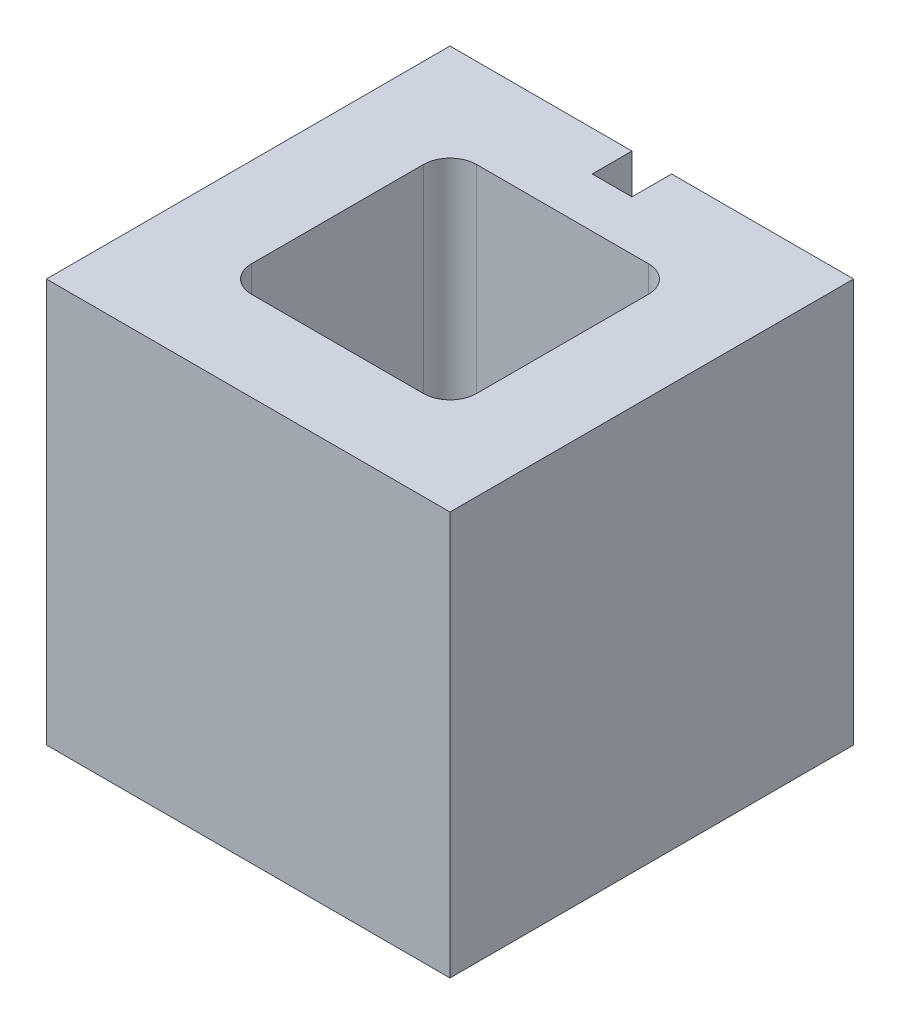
ISO-10303-21;
HEADER;
FILE_DESCRIPTION(('STEP AP214'),'2;1');
FILE_NAME('part.step','',(''),(''),'','','');
FILE_SCHEMA(('AUTOMOTIVE_DESIGN { 1 0 10303 214 1 1 1 1 }'));
ENDSEC;
DATA;
#1=APPLICATION_CONTEXT('core data for automotive mechanical design processes');
#2=APPLICATION_PROTOCOL_DEFINITION('international standard','automotive_design',2000,#1);
#3=PRODUCT_CONTEXT('',#1,'mechanical');
#4=PRODUCT('Part','Part','',(#3));
#5=PRODUCT_RELATED_PRODUCT_CATEGORY('part','',(#4));
#6=PRODUCT_DEFINITION_FORMATION('','',#4);
#7=PRODUCT_DEFINITION_CONTEXT('part definition',#1,'design');
#8=PRODUCT_DEFINITION('design','',#6,#7);
#9=PRODUCT_DEFINITION_SHAPE('','',#8);
#10=(LENGTH_UNIT() NAMED_UNIT(*) SI_UNIT(.MILLI.,.METRE.));
#11=(NAMED_UNIT(*) PLANE_ANGLE_UNIT() SI_UNIT($,.RADIAN.));
#12=(NAMED_UNIT(*) SI_UNIT($,.STERADIAN.) SOLID_ANGLE_UNIT());
#13=UNCERTAINTY_MEASURE_WITH_UNIT(LENGTH_MEASURE(1.E-05),#10,'distance_accuracy_value','');
#14=(GEOMETRIC_REPRESENTATION_CONTEXT(3) GLOBAL_UNCERTAINTY_ASSIGNED_CONTEXT((#13)) GLOBAL_UNIT_ASSIGNED_CONTEXT((#10,
#11,#12)) REPRESENTATION_CONTEXT('',''));
#15=CARTESIAN_POINT('',(0.,0.,0.));
#16=DIRECTION('',(0.,0.,1.));
#17=DIRECTION('',(1.,0.,0.));
#18=AXIS2_PLACEMENT_3D('',#15,#16,#17);
#19=CARTESIAN_POINT('',(0.,193.675,-193.675));
#20=DIRECTION('',(0.,0.,1.));
#21=DIRECTION('',(1.,0.,0.));
#22=AXIS2_PLACEMENT_3D('',#19,#20,#21);
#23=PLANE('',#22);
#24=DIRECTION('',(-1.,0.,0.));
#25=VECTOR('',#24,1.);
#26=CARTESIAN_POINT('',(0.,193.675,-193.675));
#27=LINE('',#26,#25);
#28=CARTESIAN_POINT('',(87.3125,193.675,-193.675));
#29=VERTEX_POINT('',#28);
#30=CARTESIAN_POINT('',(0.,193.675,-193.675));
#31=VERTEX_POINT('',#30);
#32=EDGE_CURVE('E263',#29,#31,#27,.T.);
#33=ORIENTED_EDGE('',*,*,#32,.F.);
#34=DIRECTION('',(0.,1.,0.));
#35=VECTOR('',#34,1.);
#36=CARTESIAN_POINT('',(87.3125,-0.001000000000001,-193.675));
#37=LINE('',#36,#35);
#38=CARTESIAN_POINT('',(87.3125,0.,-193.675));
#39=VERTEX_POINT('',#38);
#40=EDGE_CURVE('E155',#39,#29,#37,.T.);
#41=ORIENTED_EDGE('',*,*,#40,.F.);
#42=DIRECTION('',(-1.,0.,0.));
#43=VECTOR('',#42,1.);
#44=CARTESIAN_POINT('',(0.,0.,-193.675));
#45=LINE('',#44,#43);
#46=CARTESIAN_POINT('',(0.,0.,-193.675));
#47=VERTEX_POINT('',#46);
#48=EDGE_CURVE('E172',#39,#47,#45,.T.);
#49=ORIENTED_EDGE('',*,*,#48,.T.);
#50=DIRECTION('',(0.,-1.,0.));
#51=VECTOR('',#50,1.);
#52=CARTESIAN_POINT('',(0.,193.675,-193.675));
#53=LINE('',#52,#51);
#54=EDGE_CURVE('E181',#31,#47,#53,.T.);
#55=ORIENTED_EDGE('',*,*,#54,.F.);
#56=EDGE_LOOP('',(#33,#41,#49,#55));
#57=FACE_BOUND('',#56,.T.);
#58=ADVANCED_FACE('F30',(#57),#23,.F.);
#59=CARTESIAN_POINT('',(0.,193.675,0.));
#60=DIRECTION('',(1.,0.,0.));
#61=DIRECTION('',(0.,0.,-1.));
#62=AXIS2_PLACEMENT_3D('',#59,#60,#61);
#63=PLANE('',#62);
#64=DIRECTION('',(0.,0.,1.));
#65=VECTOR('',#64,1.);
#66=CARTESIAN_POINT('',(0.,0.,0.));
#67=LINE('',#66,#65);
#68=CARTESIAN_POINT('',(0.,0.,0.));
#69=VERTEX_POINT('',#68);
#70=EDGE_CURVE('E258',#47,#69,#67,.T.);
#71=ORIENTED_EDGE('',*,*,#70,.T.);
#72=DIRECTION('',(0.,-1.,0.));
#73=VECTOR('',#72,1.);
#74=CARTESIAN_POINT('',(0.,193.675,0.));
#75=LINE('',#74,#73);
#76=CARTESIAN_POINT('',(0.,193.675,0.));
#77=VERTEX_POINT('',#76);
#78=EDGE_CURVE('E189',#77,#69,#75,.T.);
#79=ORIENTED_EDGE('',*,*,#78,.F.);
#80=DIRECTION('',(0.,0.,1.));
#81=VECTOR('',#80,1.);
#82=CARTESIAN_POINT('',(0.,193.675,0.));
#83=LINE('',#82,#81);
#84=EDGE_CURVE('E171',#31,#77,#83,.T.);
#85=ORIENTED_EDGE('',*,*,#84,.F.);
#86=ORIENTED_EDGE('',*,*,#54,.T.);
#87=EDGE_LOOP('',(#71,#79,#85,#86));
#88=FACE_BOUND('',#87,.T.);
#89=ADVANCED_FACE('F278',(#88),#63,.F.);
#90=CARTESIAN_POINT('',(0.,193.675,0.));
#91=DIRECTION('',(0.,0.,-1.));
#92=DIRECTION('',(-1.,0.,0.));
#93=AXIS2_PLACEMENT_3D('',#90,#91,#92);
#94=PLANE('',#93);
#95=DIRECTION('',(1.,0.,0.));
#96=VECTOR('',#95,1.);
#97=CARTESIAN_POINT('',(0.,0.,0.));
#98=LINE('',#97,#96);
#99=CARTESIAN_POINT('',(193.675,0.,0.));
#100=VERTEX_POINT('',#99);
#101=EDGE_CURVE('E266',#69,#100,#98,.T.);
#102=ORIENTED_EDGE('',*,*,#101,.T.);
#103=DIRECTION('',(0.,-1.,0.));
#104=VECTOR('',#103,1.);
#105=CARTESIAN_POINT('',(193.675,193.675,0.));
#106=LINE('',#105,#104);
#107=CARTESIAN_POINT('',(193.675,193.675,0.));
#108=VERTEX_POINT('',#107);
#109=EDGE_CURVE('E186',#108,#100,#106,.T.);
#110=ORIENTED_EDGE('',*,*,#109,.F.);
#111=DIRECTION('',(1.,0.,0.));
#112=VECTOR('',#111,1.);
#113=CARTESIAN_POINT('',(0.,193.675,0.));
#114=LINE('',#113,#112);
#115=EDGE_CURVE('E175',#77,#108,#114,.T.);
#116=ORIENTED_EDGE('',*,*,#115,.F.);
#117=ORIENTED_EDGE('',*,*,#78,.T.);
#118=EDGE_LOOP('',(#102,#110,#116,#117));
#119=FACE_BOUND('',#118,.T.);
#120=ADVANCED_FACE('F275',(#119),#94,.F.);
#121=CARTESIAN_POINT('',(193.675,193.675,0.));
#122=DIRECTION('',(-1.,0.,0.));
#123=DIRECTION('',(0.,0.,1.));
#124=AXIS2_PLACEMENT_3D('',#121,#122,#123);
#125=PLANE('',#124);
#126=DIRECTION('',(0.,0.,-1.));
#127=VECTOR('',#126,1.);
#128=CARTESIAN_POINT('',(193.675,0.,0.));
#129=LINE('',#128,#127);
#130=CARTESIAN_POINT('',(193.675,0.,-193.675));
#131=VERTEX_POINT('',#130);
#132=EDGE_CURVE('E177',#100,#131,#129,.T.);
#133=ORIENTED_EDGE('',*,*,#132,.T.);
#134=DIRECTION('',(0.,-1.,0.));
#135=VECTOR('',#134,1.);
#136=CARTESIAN_POINT('',(193.675,193.675,-193.675));
#137=LINE('',#136,#135);
#138=CARTESIAN_POINT('',(193.675,193.675,-193.675));
#139=VERTEX_POINT('',#138);
#140=EDGE_CURVE('E170',#139,#131,#137,.T.);
#141=ORIENTED_EDGE('',*,*,#140,.F.);
#142=DIRECTION('',(0.,0.,-1.));
#143=VECTOR('',#142,1.);
#144=CARTESIAN_POINT('',(193.675,193.675,0.));
#145=LINE('',#144,#143);
#146=EDGE_CURVE('E261',#108,#139,#145,.T.);
#147=ORIENTED_EDGE('',*,*,#146,.F.);
#148=ORIENTED_EDGE('',*,*,#109,.T.);
#149=EDGE_LOOP('',(#133,#141,#147,#148));
#150=FACE_BOUND('',#149,.T.);
#151=ADVANCED_FACE('F270',(#150),#125,.F.);
#152=CARTESIAN_POINT('',(106.3625,0.,-193.675));
#153=VERTEX_POINT('',#152);
#154=EDGE_CURVE('E163',#131,#153,#45,.T.);
#155=ORIENTED_EDGE('',*,*,#154,.T.);
#156=DIRECTION('',(0.,1.,0.));
#157=VECTOR('',#156,1.);
#158=CARTESIAN_POINT('',(106.3625,-0.001000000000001,-193.675));
#159=LINE('',#158,#157);
#160=CARTESIAN_POINT('',(106.3625,193.675,-193.675));
#161=VERTEX_POINT('',#160);
#162=EDGE_CURVE('E144',#153,#161,#159,.T.);
#163=ORIENTED_EDGE('',*,*,#162,.T.);
#164=EDGE_CURVE('E184',#139,#161,#27,.T.);
#165=ORIENTED_EDGE('',*,*,#164,.F.);
#166=ORIENTED_EDGE('',*,*,#140,.T.);
#167=EDGE_LOOP('',(#155,#163,#165,#166));
#168=FACE_BOUND('',#167,.T.);
#169=ADVANCED_FACE('F168',(#168),#23,.F.);
#170=CARTESIAN_POINT('',(0.,193.675,-193.675));
#171=DIRECTION('',(0.,-1.,0.));
#172=DIRECTION('',(0.,0.,-1.));
#173=AXIS2_PLACEMENT_3D('',#170,#171,#172);
#174=PLANE('',#173);
#175=DIRECTION('',(1.,0.,0.));
#176=VECTOR('',#175,1.);
#177=CARTESIAN_POINT('',(42.8625,193.675,-42.8625));
#178=LINE('',#177,#176);
#179=CARTESIAN_POINT('',(55.5625,193.675,-42.8625));
#180=VERTEX_POINT('',#179);
#181=CARTESIAN_POINT('',(138.1125,193.675,-42.8625));
#182=VERTEX_POINT('',#181);
#183=EDGE_CURVE('E247',#180,#182,#178,.T.);
#184=ORIENTED_EDGE('',*,*,#183,.F.);
#185=CARTESIAN_POINT('',(55.5625,193.675,-55.5625));
#186=DIRECTION('',(0.,-1.,0.));
#187=DIRECTION('',(0.,0.,-1.));
#188=AXIS2_PLACEMENT_3D('',#185,#186,#187);
#189=CIRCLE('',#188,12.7);
#190=CARTESIAN_POINT('',(42.8625,193.675,-55.5625));
#191=VERTEX_POINT('',#190);
#192=EDGE_CURVE('E211',#180,#191,#189,.T.);
#193=ORIENTED_EDGE('',*,*,#192,.T.);
#194=DIRECTION('',(0.,0.,1.));
#195=VECTOR('',#194,1.);
#196=CARTESIAN_POINT('',(42.8625,193.675,-150.8125));
#197=LINE('',#196,#195);
#198=CARTESIAN_POINT('',(42.8625,193.675,-138.1125));
#199=VERTEX_POINT('',#198);
#200=EDGE_CURVE('E229',#199,#191,#197,.T.);
#201=ORIENTED_EDGE('',*,*,#200,.F.);
#202=CARTESIAN_POINT('',(55.5625,193.675,-138.1125));
#203=DIRECTION('',(0.,-1.,0.));
#204=DIRECTION('',(0.,0.,-1.));
#205=AXIS2_PLACEMENT_3D('',#202,#203,#204);
#206=CIRCLE('',#205,12.7);
#207=CARTESIAN_POINT('',(55.5625,193.675,-150.8125));
#208=VERTEX_POINT('',#207);
#209=EDGE_CURVE('E38',#199,#208,#206,.T.);
#210=ORIENTED_EDGE('',*,*,#209,.T.);
#211=DIRECTION('',(-1.,0.,0.));
#212=VECTOR('',#211,1.);
#213=CARTESIAN_POINT('',(42.8625,193.675,-150.8125));
#214=LINE('',#213,#212);
#215=CARTESIAN_POINT('',(138.1125,193.675,-150.8125));
#216=VERTEX_POINT('',#215);
#217=EDGE_CURVE('E227',#216,#208,#214,.T.);
#218=ORIENTED_EDGE('',*,*,#217,.F.);
#219=CARTESIAN_POINT('',(138.1125,193.675,-138.1125));
#220=DIRECTION('',(0.,-1.,0.));
#221=DIRECTION('',(0.,0.,-1.));
#222=AXIS2_PLACEMENT_3D('',#219,#220,#221);
#223=CIRCLE('',#222,12.7);
#224=CARTESIAN_POINT('',(150.8125,193.675,-138.1125));
#225=VERTEX_POINT('',#224);
#226=EDGE_CURVE('E219',#216,#225,#223,.T.);
#227=ORIENTED_EDGE('',*,*,#226,.T.);
#228=DIRECTION('',(0.,0.,-1.));
#229=VECTOR('',#228,1.);
#230=CARTESIAN_POINT('',(150.8125,193.675,-150.8125));
#231=LINE('',#230,#229);
#232=CARTESIAN_POINT('',(150.8125,193.675,-55.5625));
#233=VERTEX_POINT('',#232);
#234=EDGE_CURVE('E235',#233,#225,#231,.T.);
#235=ORIENTED_EDGE('',*,*,#234,.F.);
#236=CARTESIAN_POINT('',(138.1125,193.675,-55.5625));
#237=DIRECTION('',(0.,-1.,0.));
#238=DIRECTION('',(0.,0.,-1.));
#239=AXIS2_PLACEMENT_3D('',#236,#237,#238);
#240=CIRCLE('',#239,12.7);
#241=EDGE_CURVE('E215',#233,#182,#240,.T.);
#242=ORIENTED_EDGE('',*,*,#241,.T.);
#243=EDGE_LOOP('',(#184,#193,#201,#210,#218,#227,#235,#242));
#244=FACE_BOUND('',#243,.T.);
#245=DIRECTION('',(1.,0.,0.));
#246=VECTOR('',#245,1.);
#247=CARTESIAN_POINT('',(87.3125,193.675,-174.625));
#248=LINE('',#247,#246);
#249=CARTESIAN_POINT('',(87.3125,193.675,-174.625));
#250=VERTEX_POINT('',#249);
#251=CARTESIAN_POINT('',(106.3625,193.675,-174.625));
#252=VERTEX_POINT('',#251);
#253=EDGE_CURVE('E288',#250,#252,#248,.T.);
#254=ORIENTED_EDGE('',*,*,#253,.F.);
#255=DIRECTION('',(0.,0.,1.));
#256=VECTOR('',#255,1.);
#257=CARTESIAN_POINT('',(87.3125,193.675,-193.675));
#258=LINE('',#257,#256);
#259=EDGE_CURVE('E285',#29,#250,#258,.T.);
#260=ORIENTED_EDGE('',*,*,#259,.F.);
#261=ORIENTED_EDGE('',*,*,#32,.T.);
#262=ORIENTED_EDGE('',*,*,#84,.T.);
#263=ORIENTED_EDGE('',*,*,#115,.T.);
#264=ORIENTED_EDGE('',*,*,#146,.T.);
#265=ORIENTED_EDGE('',*,*,#164,.T.);
#266=DIRECTION('',(0.,0.,-1.));
#267=VECTOR('',#266,1.);
#268=CARTESIAN_POINT('',(106.3625,193.675,-193.675));
#269=LINE('',#268,#267);
#270=EDGE_CURVE('E150',#252,#161,#269,.T.);
#271=ORIENTED_EDGE('',*,*,#270,.F.);
#272=EDGE_LOOP('',(#254,#260,#261,#262,#263,#264,#265,#271));
#273=FACE_BOUND('',#272,.T.);
#274=ADVANCED_FACE('F225',(#244,#273),#174,.F.);
#275=CARTESIAN_POINT('',(0.,0.,-193.675));
#276=DIRECTION('',(0.,-1.,0.));
#277=DIRECTION('',(0.,0.,-1.));
#278=AXIS2_PLACEMENT_3D('',#275,#276,#277);
#279=PLANE('',#278);
#280=DIRECTION('',(0.,0.,1.));
#281=VECTOR('',#280,1.);
#282=CARTESIAN_POINT('',(87.3125,0.,-193.675));
#283=LINE('',#282,#281);
#284=CARTESIAN_POINT('',(87.3125,0.,-174.625));
#285=VERTEX_POINT('',#284);
#286=EDGE_CURVE('E165',#39,#285,#283,.T.);
#287=ORIENTED_EDGE('',*,*,#286,.T.);
#288=DIRECTION('',(1.,0.,0.));
#289=VECTOR('',#288,1.);
#290=CARTESIAN_POINT('',(87.3125,0.,-174.625));
#291=LINE('',#290,#289);
#292=CARTESIAN_POINT('',(106.3625,0.,-174.625));
#293=VERTEX_POINT('',#292);
#294=EDGE_CURVE('E164',#285,#293,#291,.T.);
#295=ORIENTED_EDGE('',*,*,#294,.T.);
#296=DIRECTION('',(0.,0.,-1.));
#297=VECTOR('',#296,1.);
#298=CARTESIAN_POINT('',(106.3625,0.,-193.675));
#299=LINE('',#298,#297);
#300=EDGE_CURVE('E147',#293,#153,#299,.T.);
#301=ORIENTED_EDGE('',*,*,#300,.T.);
#302=ORIENTED_EDGE('',*,*,#154,.F.);
#303=ORIENTED_EDGE('',*,*,#132,.F.);
#304=ORIENTED_EDGE('',*,*,#101,.F.);
#305=ORIENTED_EDGE('',*,*,#70,.F.);
#306=ORIENTED_EDGE('',*,*,#48,.F.);
#307=EDGE_LOOP('',(#287,#295,#301,#302,#303,#304,#305,#306));
#308=FACE_BOUND('',#307,.T.);
#309=DIRECTION('',(-1.,0.,0.));
#310=VECTOR('',#309,1.);
#311=CARTESIAN_POINT('',(42.8625,0.,-150.8125));
#312=LINE('',#311,#310);
#313=CARTESIAN_POINT('',(138.1125,0.,-150.8125));
#314=VERTEX_POINT('',#313);
#315=CARTESIAN_POINT('',(55.5625,0.,-150.8125));
#316=VERTEX_POINT('',#315);
#317=EDGE_CURVE('E242',#314,#316,#312,.T.);
#318=ORIENTED_EDGE('',*,*,#317,.T.);
#319=CARTESIAN_POINT('',(55.5625,0.,-138.1125));
#320=DIRECTION('',(0.,-1.,0.));
#321=DIRECTION('',(0.,0.,-1.));
#322=AXIS2_PLACEMENT_3D('',#319,#320,#321);
#323=CIRCLE('',#322,12.7);
#324=CARTESIAN_POINT('',(42.8625,0.,-138.1125));
#325=VERTEX_POINT('',#324);
#326=EDGE_CURVE('E11',#316,#325,#323,.F.);
#327=ORIENTED_EDGE('',*,*,#326,.T.);
#328=DIRECTION('',(0.,0.,1.));
#329=VECTOR('',#328,1.);
#330=CARTESIAN_POINT('',(42.8625,0.,-150.8125));
#331=LINE('',#330,#329);
#332=CARTESIAN_POINT('',(42.8625,0.,-55.5625));
#333=VERTEX_POINT('',#332);
#334=EDGE_CURVE('E240',#325,#333,#331,.T.);
#335=ORIENTED_EDGE('',*,*,#334,.T.);
#336=CARTESIAN_POINT('',(55.5625,0.,-55.5625));
#337=DIRECTION('',(0.,-1.,0.));
#338=DIRECTION('',(0.,0.,-1.));
#339=AXIS2_PLACEMENT_3D('',#336,#337,#338);
#340=CIRCLE('',#339,12.7);
#341=CARTESIAN_POINT('',(55.5625,0.,-42.8625));
#342=VERTEX_POINT('',#341);
#343=EDGE_CURVE('E213',#333,#342,#340,.F.);
#344=ORIENTED_EDGE('',*,*,#343,.T.);
#345=DIRECTION('',(1.,0.,0.));
#346=VECTOR('',#345,1.);
#347=CARTESIAN_POINT('',(42.8625,0.,-42.8625));
#348=LINE('',#347,#346);
#349=CARTESIAN_POINT('',(138.1125,0.,-42.8625));
#350=VERTEX_POINT('',#349);
#351=EDGE_CURVE('E234',#342,#350,#348,.T.);
#352=ORIENTED_EDGE('',*,*,#351,.T.);
#353=CARTESIAN_POINT('',(138.1125,0.,-55.5625));
#354=DIRECTION('',(0.,-1.,0.));
#355=DIRECTION('',(0.,0.,-1.));
#356=AXIS2_PLACEMENT_3D('',#353,#354,#355);
#357=CIRCLE('',#356,12.7);
#358=CARTESIAN_POINT('',(150.8125,0.,-55.5625));
#359=VERTEX_POINT('',#358);
#360=EDGE_CURVE('E217',#350,#359,#357,.F.);
#361=ORIENTED_EDGE('',*,*,#360,.T.);
#362=DIRECTION('',(0.,0.,-1.));
#363=VECTOR('',#362,1.);
#364=CARTESIAN_POINT('',(150.8125,0.,-150.8125));
#365=LINE('',#364,#363);
#366=CARTESIAN_POINT('',(150.8125,0.,-138.1125));
#367=VERTEX_POINT('',#366);
#368=EDGE_CURVE('E249',#359,#367,#365,.T.);
#369=ORIENTED_EDGE('',*,*,#368,.T.);
#370=CARTESIAN_POINT('',(138.1125,0.,-138.1125));
#371=DIRECTION('',(0.,-1.,0.));
#372=DIRECTION('',(0.,0.,-1.));
#373=AXIS2_PLACEMENT_3D('',#370,#371,#372);
#374=CIRCLE('',#373,12.7);
#375=EDGE_CURVE('E52',#367,#314,#374,.F.);
#376=ORIENTED_EDGE('',*,*,#375,.T.);
#377=EDGE_LOOP('',(#318,#327,#335,#344,#352,#361,#369,#376));
#378=FACE_BOUND('',#377,.T.);
#379=ADVANCED_FACE('F161',(#308,#378),#279,.T.);
#380=CARTESIAN_POINT('',(42.8625,-0.001000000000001,-150.8125));
#381=DIRECTION('',(-1.,0.,0.));
#382=DIRECTION('',(0.,0.,1.));
#383=AXIS2_PLACEMENT_3D('',#380,#381,#382);
#384=PLANE('',#383);
#385=ORIENTED_EDGE('',*,*,#200,.T.);
#386=DIRECTION('',(0.,1.,0.));
#387=VECTOR('',#386,1.);
#388=CARTESIAN_POINT('',(42.8625,0.,-55.5625));
#389=LINE('',#388,#387);
#390=EDGE_CURVE('E200',#191,#333,#389,.F.);
#391=ORIENTED_EDGE('',*,*,#390,.T.);
#392=ORIENTED_EDGE('',*,*,#334,.F.);
#393=DIRECTION('',(0.,1.,0.));
#394=VECTOR('',#393,1.);
#395=CARTESIAN_POINT('',(42.8625,193.675,-138.1125));
#396=LINE('',#395,#394);
#397=EDGE_CURVE('E197',#325,#199,#396,.T.);
#398=ORIENTED_EDGE('',*,*,#397,.T.);
#399=EDGE_LOOP('',(#385,#391,#392,#398));
#400=FACE_BOUND('',#399,.T.);
#401=ADVANCED_FACE('F244',(#400),#384,.F.);
#402=CARTESIAN_POINT('',(42.8625,-0.001000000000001,-150.8125));
#403=DIRECTION('',(0.,0.,-1.));
#404=DIRECTION('',(-1.,0.,0.));
#405=AXIS2_PLACEMENT_3D('',#402,#403,#404);
#406=PLANE('',#405);
#407=ORIENTED_EDGE('',*,*,#317,.F.);
#408=DIRECTION('',(0.,1.,0.));
#409=VECTOR('',#408,1.);
#410=CARTESIAN_POINT('',(138.1125,193.675,-150.8125));
#411=LINE('',#410,#409);
#412=EDGE_CURVE('E208',#314,#216,#411,.T.);
#413=ORIENTED_EDGE('',*,*,#412,.T.);
#414=ORIENTED_EDGE('',*,*,#217,.T.);
#415=DIRECTION('',(0.,1.,0.));
#416=VECTOR('',#415,1.);
#417=CARTESIAN_POINT('',(55.5625,0.,-150.8125));
#418=LINE('',#417,#416);
#419=EDGE_CURVE('E45',#208,#316,#418,.F.);
#420=ORIENTED_EDGE('',*,*,#419,.T.);
#421=EDGE_LOOP('',(#407,#413,#414,#420));
#422=FACE_BOUND('',#421,.T.);
#423=ADVANCED_FACE('F232',(#422),#406,.F.);
#424=CARTESIAN_POINT('',(150.8125,-0.001000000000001,-150.8125));
#425=DIRECTION('',(1.,0.,0.));
#426=DIRECTION('',(0.,0.,-1.));
#427=AXIS2_PLACEMENT_3D('',#424,#425,#426);
#428=PLANE('',#427);
#429=ORIENTED_EDGE('',*,*,#368,.F.);
#430=DIRECTION('',(0.,1.,0.));
#431=VECTOR('',#430,1.);
#432=CARTESIAN_POINT('',(150.8125,193.675,-55.5625));
#433=LINE('',#432,#431);
#434=EDGE_CURVE('E204',#359,#233,#433,.T.);
#435=ORIENTED_EDGE('',*,*,#434,.T.);
#436=ORIENTED_EDGE('',*,*,#234,.T.);
#437=DIRECTION('',(0.,1.,0.));
#438=VECTOR('',#437,1.);
#439=CARTESIAN_POINT('',(150.8125,0.,-138.1125));
#440=LINE('',#439,#438);
#441=EDGE_CURVE('E202',#225,#367,#440,.F.);
#442=ORIENTED_EDGE('',*,*,#441,.T.);
#443=EDGE_LOOP('',(#429,#435,#436,#442));
#444=FACE_BOUND('',#443,.T.);
#445=ADVANCED_FACE('F306',(#444),#428,.F.);
#446=CARTESIAN_POINT('',(42.8625,-0.001000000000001,-42.8625));
#447=DIRECTION('',(0.,0.,1.));
#448=DIRECTION('',(1.,0.,0.));
#449=AXIS2_PLACEMENT_3D('',#446,#447,#448);
#450=PLANE('',#449);
#451=ORIENTED_EDGE('',*,*,#351,.F.);
#452=DIRECTION('',(0.,1.,0.));
#453=VECTOR('',#452,1.);
#454=CARTESIAN_POINT('',(55.5625,193.675,-42.8625));
#455=LINE('',#454,#453);
#456=EDGE_CURVE('E194',#342,#180,#455,.T.);
#457=ORIENTED_EDGE('',*,*,#456,.T.);
#458=ORIENTED_EDGE('',*,*,#183,.T.);
#459=DIRECTION('',(0.,1.,0.));
#460=VECTOR('',#459,1.);
#461=CARTESIAN_POINT('',(138.1125,0.,-42.8625));
#462=LINE('',#461,#460);
#463=EDGE_CURVE('E192',#182,#350,#462,.F.);
#464=ORIENTED_EDGE('',*,*,#463,.T.);
#465=EDGE_LOOP('',(#451,#457,#458,#464));
#466=FACE_BOUND('',#465,.T.);
#467=ADVANCED_FACE('F312',(#466),#450,.F.);
#468=CARTESIAN_POINT('',(87.3125,-0.001000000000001,-193.675));
#469=DIRECTION('',(-1.,0.,0.));
#470=DIRECTION('',(0.,0.,1.));
#471=AXIS2_PLACEMENT_3D('',#468,#469,#470);
#472=PLANE('',#471);
#473=ORIENTED_EDGE('',*,*,#40,.T.);
#474=ORIENTED_EDGE('',*,*,#259,.T.);
#475=DIRECTION('',(0.,1.,0.));
#476=VECTOR('',#475,1.);
#477=CARTESIAN_POINT('',(87.3125,-0.001000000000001,-174.625));
#478=LINE('',#477,#476);
#479=EDGE_CURVE('E294',#285,#250,#478,.T.);
#480=ORIENTED_EDGE('',*,*,#479,.F.);
#481=ORIENTED_EDGE('',*,*,#286,.F.);
#482=EDGE_LOOP('',(#473,#474,#480,#481));
#483=FACE_BOUND('',#482,.T.);
#484=ADVANCED_FACE('F408',(#483),#472,.F.);
#485=CARTESIAN_POINT('',(106.3625,-0.001000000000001,-193.675));
#486=DIRECTION('',(1.,0.,0.));
#487=DIRECTION('',(0.,0.,-1.));
#488=AXIS2_PLACEMENT_3D('',#485,#486,#487);
#489=PLANE('',#488);
#490=DIRECTION('',(0.,1.,0.));
#491=VECTOR('',#490,1.);
#492=CARTESIAN_POINT('',(106.3625,-0.001000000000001,-174.625));
#493=LINE('',#492,#491);
#494=EDGE_CURVE('E156',#293,#252,#493,.T.);
#495=ORIENTED_EDGE('',*,*,#494,.T.);
#496=ORIENTED_EDGE('',*,*,#270,.T.);
#497=ORIENTED_EDGE('',*,*,#162,.F.);
#498=ORIENTED_EDGE('',*,*,#300,.F.);
#499=EDGE_LOOP('',(#495,#496,#497,#498));
#500=FACE_BOUND('',#499,.T.);
#501=ADVANCED_FACE('F146',(#500),#489,.F.);
#502=CARTESIAN_POINT('',(87.3125,-0.001000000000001,-174.625));
#503=DIRECTION('',(0.,0.,1.));
#504=DIRECTION('',(1.,0.,0.));
#505=AXIS2_PLACEMENT_3D('',#502,#503,#504);
#506=PLANE('',#505);
#507=ORIENTED_EDGE('',*,*,#479,.T.);
#508=ORIENTED_EDGE('',*,*,#253,.T.);
#509=ORIENTED_EDGE('',*,*,#494,.F.);
#510=ORIENTED_EDGE('',*,*,#294,.F.);
#511=EDGE_LOOP('',(#507,#508,#509,#510));
#512=FACE_BOUND('',#511,.T.);
#513=ADVANCED_FACE('F317',(#512),#506,.F.);
#514=CARTESIAN_POINT('',(55.5625,-0.001000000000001,-55.5625));
#515=DIRECTION('',(0.,-1.,0.));
#516=DIRECTION('',(0.,0.,-1.));
#517=AXIS2_PLACEMENT_3D('',#514,#515,#516);
#518=CYLINDRICAL_SURFACE('',#517,12.7);
#519=ORIENTED_EDGE('',*,*,#343,.F.);
#520=ORIENTED_EDGE('',*,*,#390,.F.);
#521=ORIENTED_EDGE('',*,*,#192,.F.);
#522=ORIENTED_EDGE('',*,*,#456,.F.);
#523=EDGE_LOOP('',(#519,#520,#521,#522));
#524=FACE_BOUND('',#523,.T.);
#525=ADVANCED_FACE('F315',(#524),#518,.F.);
#526=CARTESIAN_POINT('',(138.1125,-0.001000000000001,-55.5625));
#527=DIRECTION('',(0.,-1.,0.));
#528=DIRECTION('',(0.,0.,-1.));
#529=AXIS2_PLACEMENT_3D('',#526,#527,#528);
#530=CYLINDRICAL_SURFACE('',#529,12.7);
#531=ORIENTED_EDGE('',*,*,#360,.F.);
#532=ORIENTED_EDGE('',*,*,#463,.F.);
#533=ORIENTED_EDGE('',*,*,#241,.F.);
#534=ORIENTED_EDGE('',*,*,#434,.F.);
#535=EDGE_LOOP('',(#531,#532,#533,#534));
#536=FACE_BOUND('',#535,.T.);
#537=ADVANCED_FACE('F308',(#536),#530,.F.);
#538=CARTESIAN_POINT('',(138.1125,-0.001000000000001,-138.1125));
#539=DIRECTION('',(0.,-1.,0.));
#540=DIRECTION('',(0.,0.,-1.));
#541=AXIS2_PLACEMENT_3D('',#538,#539,#540);
#542=CYLINDRICAL_SURFACE('',#541,12.7);
#543=ORIENTED_EDGE('',*,*,#375,.F.);
#544=ORIENTED_EDGE('',*,*,#441,.F.);
#545=ORIENTED_EDGE('',*,*,#226,.F.);
#546=ORIENTED_EDGE('',*,*,#412,.F.);
#547=EDGE_LOOP('',(#543,#544,#545,#546));
#548=FACE_BOUND('',#547,.T.);
#549=ADVANCED_FACE('F304',(#548),#542,.F.);
#550=CARTESIAN_POINT('',(55.5625,-0.001000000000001,-138.1125));
#551=DIRECTION('',(0.,-1.,0.));
#552=DIRECTION('',(0.,0.,-1.));
#553=AXIS2_PLACEMENT_3D('',#550,#551,#552);
#554=CYLINDRICAL_SURFACE('',#553,12.7);
#555=ORIENTED_EDGE('',*,*,#326,.F.);
#556=ORIENTED_EDGE('',*,*,#419,.F.);
#557=ORIENTED_EDGE('',*,*,#209,.F.);
#558=ORIENTED_EDGE('',*,*,#397,.F.);
#559=EDGE_LOOP('',(#555,#556,#557,#558));
#560=FACE_BOUND('',#559,.T.);
#561=ADVANCED_FACE('F32',(#560),#554,.F.);
#562=CLOSED_SHELL('',(#58,#89,#120,#151,#169,#274,#379,#401,#423,#445,#467,#484,#501,#513,#525,
#537,#549,#561));
#563=MANIFOLD_SOLID_BREP('B2',#562);
#564=ADVANCED_BREP_SHAPE_REPRESENTATION('',(#18,#563),#14);
#565=SHAPE_DEFINITION_REPRESENTATION(#9,#564);
ENDSEC;
END-ISO-10303-21;
